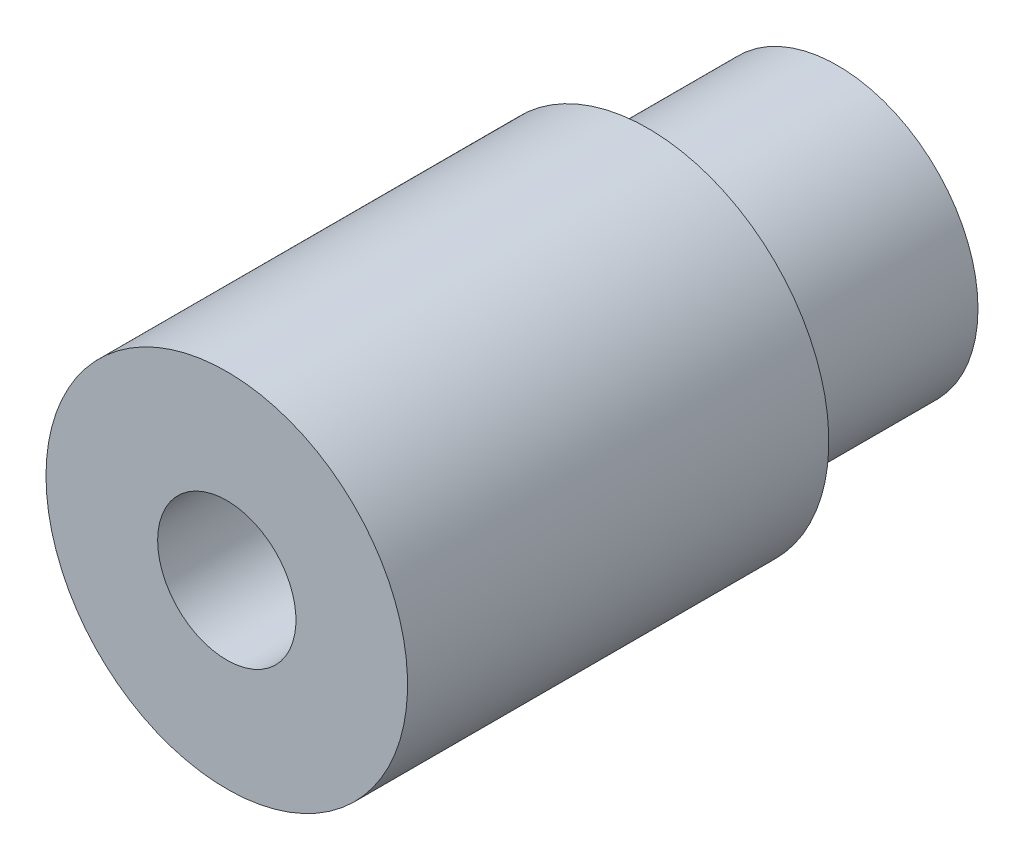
from build123d import *


with BuildPart() as part:
    # Sketch1 → Revolve1 (revolve)
    with BuildSketch(Plane(origin=(0, 0, 0), x_dir=(1, 0, 0), z_dir=(0, 1, 0))):
        Polygon((-2.5019, -36.766363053), (-6.5405, -36.766363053), (-6.5405, -21.526363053), (-5.08, -21.526363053), (-5.08, -14.668363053), (-2.5019, -14.668363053), align=None)
    revolve(axis=Axis((0, 0, -83.406454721), (0, 0, 1)))


solid = part.part
